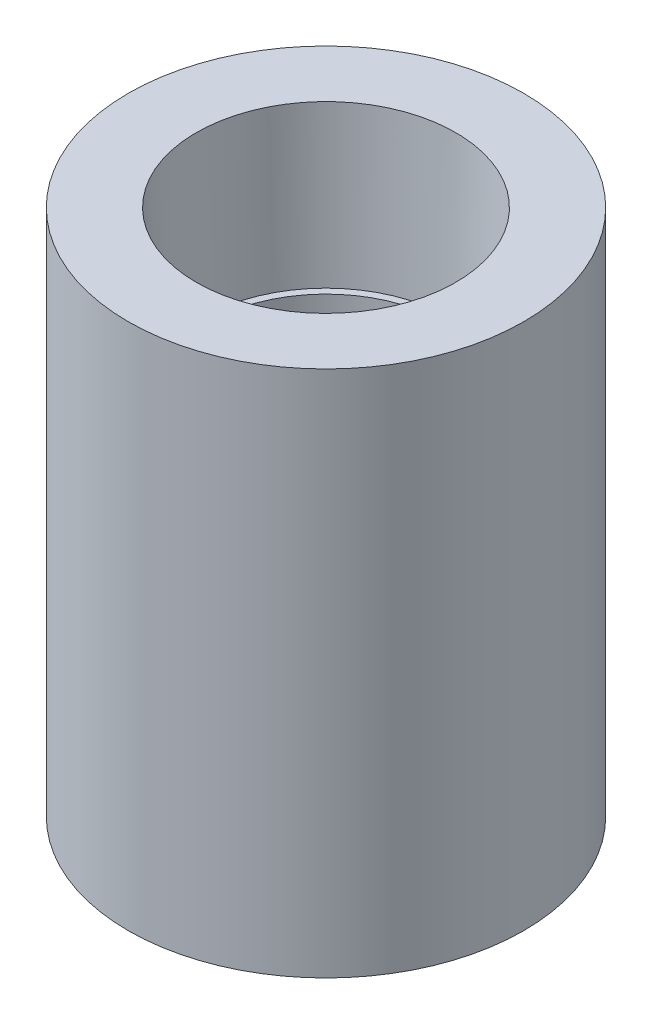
from build123d import *

# Parameters (mm, degrees)
SKICA1_R                = 15
P_IDAT_VYSUNUT_M1_DEPTH = 40


with BuildPart() as part:
    # Skica1 → P_idat vysunut_m1 (new body)
    with BuildSketch(Plane(origin=(0, 0, 0), x_dir=(1, 0, 0), z_dir=(0, 1, 0))):
        with Locations(Location((0, 0, 0), (0, 0, 270))):
            Circle(SKICA1_R)
    extrude(amount=P_IDAT_VYSUNUT_M1_DEPTH)

    # Skica2 → 1_2 s_rii z_vitu1 (revolve, cut)
    with BuildSketch(Plane(origin=(0, 40, 0), x_dir=(0, 0, 1), z_dir=(1, 0, 0))):
        Polygon((0, 0), (0, 25.154640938), (8.9281, 20), (8.9281, 12), (9.47972413, 12), (9.8390202, 0), align=None)
    revolve(axis=Axis((0, 46.35, 0), (0, -1, 0)), mode=Mode.SUBTRACT)


solid = part.part
